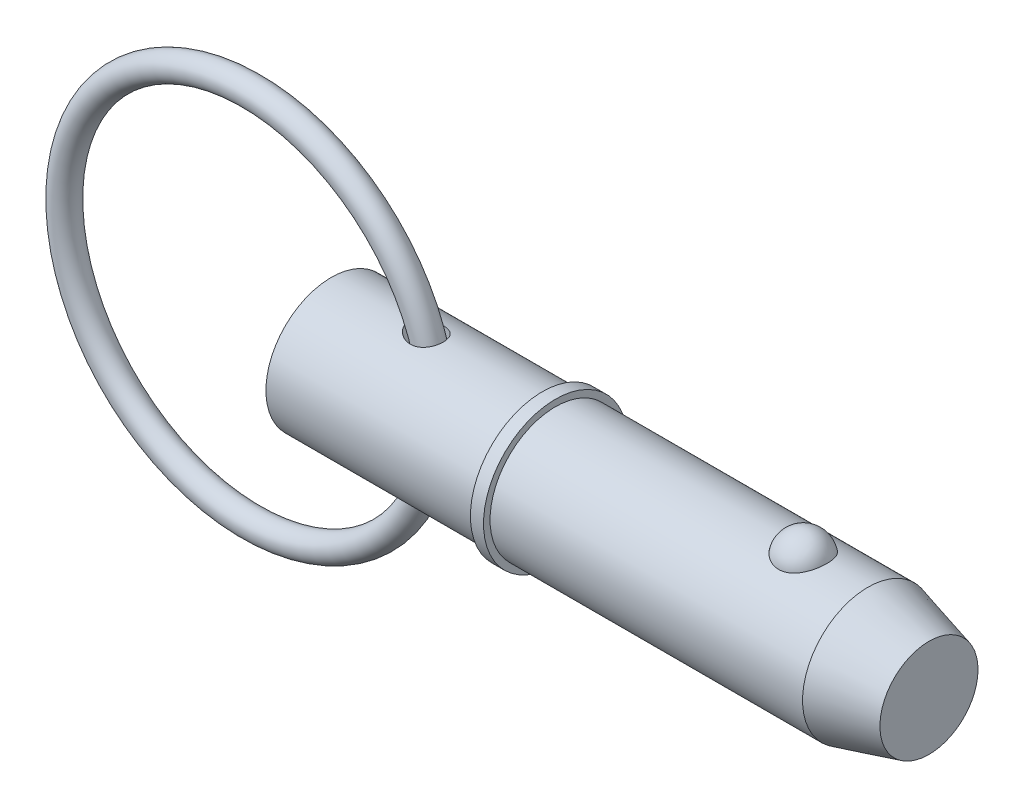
ISO-10303-21;
HEADER;
FILE_DESCRIPTION(('STEP AP214'),'2;1');
FILE_NAME('part.step','',(''),(''),'','','');
FILE_SCHEMA(('AUTOMOTIVE_DESIGN { 1 0 10303 214 1 1 1 1 }'));
ENDSEC;
DATA;
#1=APPLICATION_CONTEXT('core data for automotive mechanical design processes');
#2=APPLICATION_PROTOCOL_DEFINITION('international standard','automotive_design',2000,#1);
#3=PRODUCT_CONTEXT('',#1,'mechanical');
#4=PRODUCT('Part','Part','',(#3));
#5=PRODUCT_RELATED_PRODUCT_CATEGORY('part','',(#4));
#6=PRODUCT_DEFINITION_FORMATION('','',#4);
#7=PRODUCT_DEFINITION_CONTEXT('part definition',#1,'design');
#8=PRODUCT_DEFINITION('design','',#6,#7);
#9=PRODUCT_DEFINITION_SHAPE('','',#8);
#10=(LENGTH_UNIT() NAMED_UNIT(*) SI_UNIT(.MILLI.,.METRE.));
#11=(NAMED_UNIT(*) PLANE_ANGLE_UNIT() SI_UNIT($,.RADIAN.));
#12=(NAMED_UNIT(*) SI_UNIT($,.STERADIAN.) SOLID_ANGLE_UNIT());
#13=UNCERTAINTY_MEASURE_WITH_UNIT(LENGTH_MEASURE(1.E-05),#10,'distance_accuracy_value','');
#14=(GEOMETRIC_REPRESENTATION_CONTEXT(3) GLOBAL_UNCERTAINTY_ASSIGNED_CONTEXT((#13)) GLOBAL_UNIT_ASSIGNED_CONTEXT((#10,
#11,#12)) REPRESENTATION_CONTEXT('',''));
#15=CARTESIAN_POINT('',(0.,0.,0.));
#16=DIRECTION('',(0.,0.,1.));
#17=DIRECTION('',(1.,0.,0.));
#18=AXIS2_PLACEMENT_3D('',#15,#16,#17);
#19=CARTESIAN_POINT('',(-13.640845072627,0.,0.));
#20=DIRECTION('',(0.,0.,1.));
#21=DIRECTION('',(1.,0.,0.));
#22=AXIS2_PLACEMENT_3D('',#19,#20,#21);
#23=TOROIDAL_SURFACE('',#22,31.75,2.223);
#24=CARTESIAN_POINT('',(20.332154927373,0.,0.));
#25=VERTEX_POINT('',#24);
#26=VERTEX_LOOP('',#25);
#27=FACE_BOUND('',#26,.T.);
#28=ADVANCED_FACE('P0_F12',(#27),#23,.T.);
#29=CLOSED_SHELL('',(#28));
#30=MANIFOLD_SOLID_BREP('P0_B1',#29);
#31=CARTESIAN_POINT('',(0.,0.,0.));
#32=DIRECTION('',(1.,0.,0.));
#33=DIRECTION('',(0.,0.,-1.));
#34=AXIS2_PLACEMENT_3D('',#31,#32,#33);
#35=CYLINDRICAL_SURFACE('',#34,11.115);
#36=CARTESIAN_POINT('',(13.5245830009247,11.0328953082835,-1.34849772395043));
#37=CARTESIAN_POINT('',(13.6190616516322,11.0150940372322,-1.49413162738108));
#38=CARTESIAN_POINT('',(13.7272589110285,10.9954577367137,-1.63076546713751));
#39=CARTESIAN_POINT('',(13.9654537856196,10.9550099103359,-1.8834727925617));
#40=CARTESIAN_POINT('',(14.0954990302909,10.9341958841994,-1.99950019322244));
#41=CARTESIAN_POINT('',(14.3718600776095,10.893854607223,-2.20871939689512));
#42=CARTESIAN_POINT('',(14.5180879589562,10.8743212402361,-2.30202655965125));
#43=CARTESIAN_POINT('',(14.8233821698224,10.8385071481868,-2.46515115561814));
#44=CARTESIAN_POINT('',(14.9824448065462,10.8222254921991,-2.53497531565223));
#45=CARTESIAN_POINT('',(15.3233581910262,10.7936101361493,-2.65430007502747));
#46=CARTESIAN_POINT('',(15.5060064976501,10.7817126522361,-2.7016502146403));
#47=CARTESIAN_POINT('',(15.8771124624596,10.7657570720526,-2.76455948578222));
#48=CARTESIAN_POINT('',(16.0655695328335,10.7616981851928,-2.78012182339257));
#49=CARTESIAN_POINT('',(16.4345152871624,10.7624400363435,-2.77724928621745));
#50=CARTESIAN_POINT('',(16.6150121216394,10.7668823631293,-2.76018977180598));
#51=CARTESIAN_POINT('',(16.9695132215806,10.7837407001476,-2.69357457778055));
#52=CARTESIAN_POINT('',(17.1435222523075,10.7961507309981,-2.64404326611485));
#53=CARTESIAN_POINT('',(17.4621418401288,10.8258984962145,-2.51928348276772));
#54=CARTESIAN_POINT('',(17.6079677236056,10.8426430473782,-2.44700611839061));
#55=CARTESIAN_POINT('',(17.884162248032,10.8794194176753,-2.27791740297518));
#56=CARTESIAN_POINT('',(18.0145349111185,10.8994503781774,-2.18111245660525));
#57=CARTESIAN_POINT('',(18.2494965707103,10.9392822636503,-1.9713196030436));
#58=CARTESIAN_POINT('',(18.3550661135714,10.9590421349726,-1.85941863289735));
#59=CARTESIAN_POINT('',(18.5458147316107,10.9970986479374,-1.61919918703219));
#60=CARTESIAN_POINT('',(18.6309947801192,11.0153953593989,-1.49088149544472));
#61=CARTESIAN_POINT('',(18.7786686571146,11.0484675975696,-1.2218388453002));
#62=CARTESIAN_POINT('',(18.8412214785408,11.063252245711,-1.08114735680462));
#63=CARTESIAN_POINT('',(18.9425265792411,11.0877718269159,-0.791025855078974));
#64=CARTESIAN_POINT('',(18.9812780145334,11.0975065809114,-0.641595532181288));
#65=CARTESIAN_POINT('',(19.0343305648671,11.1109435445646,-0.336997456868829));
#66=CARTESIAN_POINT('',(19.0484404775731,11.1145985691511,-0.181794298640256));
#67=CARTESIAN_POINT('',(19.0513147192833,11.1153384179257,0.1288646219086));
#68=CARTESIAN_POINT('',(19.0400783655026,11.112423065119,0.284320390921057));
#69=CARTESIAN_POINT('',(18.9924362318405,11.1003163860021,0.591525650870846));
#70=CARTESIAN_POINT('',(18.9559600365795,11.0911075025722,0.743263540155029));
#71=CARTESIAN_POINT('',(18.858576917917,11.0673920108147,1.03825247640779));
#72=CARTESIAN_POINT('',(18.7976699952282,11.0528854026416,1.18150352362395));
#73=CARTESIAN_POINT('',(18.6529960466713,11.020201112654,1.45511394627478));
#74=CARTESIAN_POINT('',(18.5692772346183,11.0020311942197,1.58549973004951));
#75=CARTESIAN_POINT('',(18.3810003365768,10.9640237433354,1.82995492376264));
#76=CARTESIAN_POINT('',(18.2764441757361,10.9441863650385,1.9440258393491));
#77=CARTESIAN_POINT('',(18.0501398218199,10.9052267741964,2.15183128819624));
#78=CARTESIAN_POINT('',(17.9285270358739,10.8861003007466,2.24571250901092));
#79=CARTESIAN_POINT('',(17.6709592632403,10.8505244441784,2.41175942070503));
#80=CARTESIAN_POINT('',(17.5350055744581,10.8340748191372,2.48392707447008));
#81=CARTESIAN_POINT('',(17.2528390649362,10.8056099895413,2.60497667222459));
#82=CARTESIAN_POINT('',(17.1066353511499,10.7935909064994,2.65387899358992));
#83=CARTESIAN_POINT('',(16.8080326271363,10.7750969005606,2.72799859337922));
#84=CARTESIAN_POINT('',(16.6556326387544,10.7686228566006,2.75321211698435));
#85=CARTESIAN_POINT('',(16.3428877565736,10.761517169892,2.78086153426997));
#86=CARTESIAN_POINT('',(16.1824599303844,10.7611149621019,2.78240297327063));
#87=CARTESIAN_POINT('',(15.863296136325,10.766478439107,2.76156874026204));
#88=CARTESIAN_POINT('',(15.7045607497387,10.7722461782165,2.73918510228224));
#89=CARTESIAN_POINT('',(15.3787211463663,10.7898500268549,2.66904167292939));
#90=CARTESIAN_POINT('',(15.2120794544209,10.8021675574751,2.6192557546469));
#91=CARTESIAN_POINT('',(14.8886284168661,10.8315482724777,2.4949635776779));
#92=CARTESIAN_POINT('',(14.731827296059,10.8486153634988,2.42043695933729));
#93=CARTESIAN_POINT('',(14.4198762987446,10.8870804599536,2.24137362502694));
#94=CARTESIAN_POINT('',(14.2658484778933,10.9087148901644,2.13492229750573));
#95=CARTESIAN_POINT('',(13.9788214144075,10.9526299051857,1.89676517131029));
#96=CARTESIAN_POINT('',(13.845804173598,10.9749099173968,1.76508120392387));
#97=CARTESIAN_POINT('',(13.6310853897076,11.012885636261,1.50762337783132));
#98=CARTESIAN_POINT('',(13.5444453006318,11.0290026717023,1.38602082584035));
#99=CARTESIAN_POINT('',(13.392158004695,11.0581740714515,1.12983363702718));
#100=CARTESIAN_POINT('',(13.3264946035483,11.0712307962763,0.995259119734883));
#101=CARTESIAN_POINT('',(13.2464179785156,11.0874250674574,0.785640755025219));
#102=CARTESIAN_POINT('',(13.2227369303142,11.0922707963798,0.71416661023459));
#103=CARTESIAN_POINT('',(13.1820656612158,11.1006486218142,0.56927708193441));
#104=CARTESIAN_POINT('',(13.1650721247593,11.1041813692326,0.495862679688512));
#105=CARTESIAN_POINT('',(13.1381118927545,11.1098070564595,0.34771199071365));
#106=CARTESIAN_POINT('',(13.1281436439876,11.1119003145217,0.272975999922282));
#107=CARTESIAN_POINT('',(13.1154243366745,11.1145746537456,0.122890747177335));
#108=CARTESIAN_POINT('',(13.1126723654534,11.1151559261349,0.0475415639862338));
#109=CARTESIAN_POINT('',(13.1151602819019,11.1146296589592,-0.160384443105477));
#110=CARTESIAN_POINT('',(13.128061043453,11.111903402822,-0.292944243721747));
#111=CARTESIAN_POINT('',(13.175691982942,11.1019662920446,-0.553751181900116));
#112=CARTESIAN_POINT('',(13.2104121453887,11.094757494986,-0.682000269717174));
#113=CARTESIAN_POINT('',(13.2891255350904,11.0787645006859,-0.901873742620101));
#114=CARTESIAN_POINT('',(13.3290466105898,11.0707438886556,-0.995044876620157));
#115=CARTESIAN_POINT('',(13.4192915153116,11.0529876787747,-1.175992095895));
#116=CARTESIAN_POINT('',(13.4696154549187,11.0432520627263,-1.26376812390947));
#117=CARTESIAN_POINT('',(13.5245830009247,11.0328953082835,-1.34849772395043));
#118=B_SPLINE_CURVE_WITH_KNOTS('',3,(#36,#37,#38,#39,#40,#41,#42,#43,#44,#45,#46,#47,#48,#49,
#50,#51,#52,#53,#54,#55,#56,#57,#58,#59,#60,#61,#62,#63,#64,#65,#66,#67,#68,#69,#70,#71,#72,#73,
#74,#75,#76,#77,#78,#79,#80,#81,#82,#83,#84,#85,#86,#87,#88,#89,#90,#91,#92,#93,#94,#95,#96,#97,
#98,#99,#100,#101,#102,#103,#104,#105,#106,#107,#108,#109,#110,#111,#112,#113,#114,#115,#116,
#117),.UNSPECIFIED.,.T.,.F.,(4,2,2,2,2,2,2,2,2,2,2,2,2,2,2,2,2,2,2,2,2,2,2,2,2,2,2,2,2,2,2,2,2,
2,2,2,2,2,2,2,4),(0.,0.523099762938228,1.04735506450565,1.5688902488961,2.09027590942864,
2.65465173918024,3.21897064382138,3.76002078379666,4.30066536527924,4.78898318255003,
5.27717362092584,5.74028268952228,6.20336964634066,6.66524040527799,7.12712754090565,
7.59258295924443,8.05805091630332,8.52482272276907,8.99159451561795,9.45738731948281,
9.92313710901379,10.3853792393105,10.8475795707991,11.3093743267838,11.771242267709,
12.2505208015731,12.7299589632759,13.2508366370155,13.7721440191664,14.334890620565,
14.8971525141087,15.3459336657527,15.7943675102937,16.0204422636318,16.2464047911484,
16.4723173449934,16.6982013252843,17.095711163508,17.4930386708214,17.7973741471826,
18.1017128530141),.UNSPECIFIED.);
#119=CARTESIAN_POINT('',(13.5245830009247,11.0328953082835,-1.34849772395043));
#120=VERTEX_POINT('',#119);
#121=EDGE_CURVE('P1_E42',#120,#120,#118,.T.);
#122=ORIENTED_EDGE('',*,*,#121,.T.);
#123=EDGE_LOOP('',(#122));
#124=FACE_BOUND('',#123,.T.);
#125=CARTESIAN_POINT('',(0.,0.,0.));
#126=DIRECTION('',(1.,0.,0.));
#127=DIRECTION('',(0.,0.,-1.));
#128=AXIS2_PLACEMENT_3D('',#125,#126,#127);
#129=CIRCLE('',#128,11.115);
#130=CARTESIAN_POINT('',(0.,0.,-11.115));
#131=VERTEX_POINT('',#130);
#132=EDGE_CURVE('P1_E9',#131,#131,#129,.T.);
#133=ORIENTED_EDGE('',*,*,#132,.T.);
#134=EDGE_LOOP('',(#133));
#135=FACE_BOUND('',#134,.T.);
#136=CARTESIAN_POINT('',(35.877,0.,0.));
#137=DIRECTION('',(1.,0.,0.));
#138=DIRECTION('',(0.,0.,-1.));
#139=AXIS2_PLACEMENT_3D('',#136,#137,#138);
#140=CIRCLE('',#139,11.115);
#141=CARTESIAN_POINT('',(35.877,0.,-11.115));
#142=VERTEX_POINT('',#141);
#143=EDGE_CURVE('P1_E25',#142,#142,#140,.T.);
#144=ORIENTED_EDGE('',*,*,#143,.F.);
#145=EDGE_LOOP('',(#144));
#146=FACE_BOUND('',#145,.T.);
#147=CARTESIAN_POINT('',(13.5245830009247,-11.0328953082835,-1.34849772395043));
#148=CARTESIAN_POINT('',(13.449887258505,-11.0469690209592,-1.233356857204));
#149=CARTESIAN_POINT('',(13.3837464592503,-11.0598986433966,-1.11255897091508));
#150=CARTESIAN_POINT('',(13.271526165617,-11.0822620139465,-0.861680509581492));
#151=CARTESIAN_POINT('',(13.2254273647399,-11.0916991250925,-0.731609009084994));
#152=CARTESIAN_POINT('',(13.1557497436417,-11.1060943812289,-0.464578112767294));
#153=CARTESIAN_POINT('',(13.1322820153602,-11.111030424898,-0.327588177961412));
#154=CARTESIAN_POINT('',(13.1098958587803,-11.1157368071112,-0.0515139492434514));
#155=CARTESIAN_POINT('',(13.1109730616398,-11.1155080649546,0.087569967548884));
#156=CARTESIAN_POINT('',(13.1367722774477,-11.110088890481,0.354927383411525));
#157=CARTESIAN_POINT('',(13.160070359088,-11.1051972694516,0.483348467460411));
#158=CARTESIAN_POINT('',(13.2268311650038,-11.091413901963,0.734581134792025));
#159=CARTESIAN_POINT('',(13.2702981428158,-11.0825213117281,0.857391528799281));
#160=CARTESIAN_POINT('',(13.3769008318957,-11.0612491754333,1.09871322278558));
#161=CARTESIAN_POINT('',(13.4406446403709,-11.048763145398,1.21694419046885));
#162=CARTESIAN_POINT('',(13.5844860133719,-11.0215642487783,1.44267020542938));
#163=CARTESIAN_POINT('',(13.6645903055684,-11.0068504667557,1.55016080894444));
#164=CARTESIAN_POINT('',(13.8511803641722,-10.9741237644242,1.76795565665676));
#165=CARTESIAN_POINT('',(13.959808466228,-10.9559422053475,1.87639683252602));
#166=CARTESIAN_POINT('',(14.1916437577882,-10.9197998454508,2.07642617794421));
#167=CARTESIAN_POINT('',(14.3148607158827,-10.901839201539,2.16800294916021));
#168=CARTESIAN_POINT('',(14.5931107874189,-10.8649902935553,2.34622033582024));
#169=CARTESIAN_POINT('',(14.7501095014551,-10.8463937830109,2.42986679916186));
#170=CARTESIAN_POINT('',(15.0757118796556,-10.8136392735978,2.57171975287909));
#171=CARTESIAN_POINT('',(15.2443214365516,-10.7994835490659,2.62991321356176));
#172=CARTESIAN_POINT('',(15.599068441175,-10.7767894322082,2.72147498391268));
#173=CARTESIAN_POINT('',(15.7856559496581,-10.768622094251,2.75321798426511));
#174=CARTESIAN_POINT('',(16.1617095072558,-10.7608206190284,2.78356776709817));
#175=CARTESIAN_POINT('',(16.3511739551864,-10.7611818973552,2.78219235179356));
#176=CARTESIAN_POINT('',(16.7138126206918,-10.7705428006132,2.7457129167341));
#177=CARTESIAN_POINT('',(16.8872269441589,-10.7789612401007,2.71287798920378));
#178=CARTESIAN_POINT('',(17.2247245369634,-10.8028011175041,2.61632772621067));
#179=CARTESIAN_POINT('',(17.3888134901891,-10.8182182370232,2.55263143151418));
#180=CARTESIAN_POINT('',(17.6871641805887,-10.8524191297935,2.40281428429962));
#181=CARTESIAN_POINT('',(17.8227812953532,-10.8707652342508,2.31928155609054));
#182=CARTESIAN_POINT('',(18.0770765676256,-10.9094513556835,2.12988301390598));
#183=CARTESIAN_POINT('',(18.1957578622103,-10.9297910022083,2.02402134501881));
#184=CARTESIAN_POINT('',(18.4088055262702,-10.9693230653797,1.79719870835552));
#185=CARTESIAN_POINT('',(18.5038890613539,-10.9885305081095,1.67691225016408));
#186=CARTESIAN_POINT('',(18.6726701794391,-11.0244347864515,1.42183894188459));
#187=CARTESIAN_POINT('',(18.7463681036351,-11.0411316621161,1.28705232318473));
#188=CARTESIAN_POINT('',(18.8708297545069,-11.0702507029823,1.00634471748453));
#189=CARTESIAN_POINT('',(18.9215212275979,-11.0826593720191,0.860390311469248));
#190=CARTESIAN_POINT('',(18.9984973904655,-11.1017993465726,0.561823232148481));
#191=CARTESIAN_POINT('',(19.0247811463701,-11.1085304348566,0.409210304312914));
#192=CARTESIAN_POINT('',(19.0524622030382,-11.1156244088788,0.100537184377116));
#193=CARTESIAN_POINT('',(19.0536873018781,-11.1159432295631,-0.0555394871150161));
#194=CARTESIAN_POINT('',(19.0307837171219,-11.110065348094,-0.365700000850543));
#195=CARTESIAN_POINT('',(19.0066544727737,-11.1038685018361,-0.519783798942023));
#196=CARTESIAN_POINT('',(18.9335163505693,-11.0856111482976,-0.821817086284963));
#197=CARTESIAN_POINT('',(18.8844701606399,-11.0735418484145,-0.969757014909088));
#198=CARTESIAN_POINT('',(18.7625929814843,-11.0448501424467,-1.25502066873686));
#199=CARTESIAN_POINT('',(18.6897623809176,-11.0282278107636,-1.39234456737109));
#200=CARTESIAN_POINT('',(18.522359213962,-10.9923333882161,-1.65195905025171));
#201=CARTESIAN_POINT('',(18.427863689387,-10.9730707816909,-1.77430060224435));
#202=CARTESIAN_POINT('',(18.2194216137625,-10.9340072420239,-2.00099176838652));
#203=CARTESIAN_POINT('',(18.1054772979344,-10.9142063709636,-2.10534344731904));
#204=CARTESIAN_POINT('',(17.8622613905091,-10.8764452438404,-2.2924289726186));
#205=CARTESIAN_POINT('',(17.7331196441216,-10.8584715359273,-2.3753290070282));
#206=CARTESIAN_POINT('',(17.4625069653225,-10.8261386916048,-2.51860389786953));
#207=CARTESIAN_POINT('',(17.3210365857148,-10.8117793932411,-2.57897976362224));
#208=CARTESIAN_POINT('',(17.0290309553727,-10.7880576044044,-2.67648805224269));
#209=CARTESIAN_POINT('',(16.8784484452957,-10.7787241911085,-2.71348542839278));
#210=CARTESIAN_POINT('',(16.573148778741,-10.7659618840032,-2.7636855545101));
#211=CARTESIAN_POINT('',(16.4184306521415,-10.7625343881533,-2.77688267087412));
#212=CARTESIAN_POINT('',(16.1008073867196,-10.761643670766,-2.78033419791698));
#213=CARTESIAN_POINT('',(15.9378898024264,-10.7644957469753,-2.76937572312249));
#214=CARTESIAN_POINT('',(15.6157286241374,-10.7762062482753,-2.72344300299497));
#215=CARTESIAN_POINT('',(15.4564861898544,-10.7850665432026,-2.68846128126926));
#216=CARTESIAN_POINT('',(15.1305734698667,-10.808737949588,-2.59174021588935));
#217=CARTESIAN_POINT('',(14.9645834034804,-10.8240246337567,-2.52782071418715));
#218=CARTESIAN_POINT('',(14.6448218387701,-10.8585969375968,-2.37491543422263));
#219=CARTESIAN_POINT('',(14.4910653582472,-10.8778873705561,-2.28589943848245));
#220=CARTESIAN_POINT('',(14.1837929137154,-10.920550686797,-2.07312951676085));
#221=CARTESIAN_POINT('',(14.0321999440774,-10.9441390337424,-1.94661563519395));
#222=CARTESIAN_POINT('',(13.756115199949,-10.9902311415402,-1.66673537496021));
#223=CARTESIAN_POINT('',(13.6315733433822,-11.0127368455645,-1.51341958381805));
#224=CARTESIAN_POINT('',(13.5245830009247,-11.0328953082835,-1.34849772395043));
#225=B_SPLINE_CURVE_WITH_KNOTS('',3,(#147,#148,#149,#150,#151,#152,#153,#154,#155,#156,#157,
#158,#159,#160,#161,#162,#163,#164,#165,#166,#167,#168,#169,#170,#171,#172,#173,#174,#175,#176,
#177,#178,#179,#180,#181,#182,#183,#184,#185,#186,#187,#188,#189,#190,#191,#192,#193,#194,#195,
#196,#197,#198,#199,#200,#201,#202,#203,#204,#205,#206,#207,#208,#209,#210,#211,#212,#213,#214,
#215,#216,#217,#218,#219,#220,#221,#222,#223,#224),.UNSPECIFIED.,.T.,.F.,(4,2,2,2,2,2,2,2,2,2,2,
2,2,2,2,2,2,2,2,2,2,2,2,2,2,2,2,2,2,2,2,2,2,2,2,2,2,2,4),(0.,0.413394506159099,
0.826389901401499,1.24140245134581,1.65634113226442,2.04635967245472,2.43646050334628,
2.83958259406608,3.24287078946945,3.70479277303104,4.16702582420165,4.70130512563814,
5.23585761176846,5.80123945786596,6.36631739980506,6.89348344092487,7.42032464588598,
7.8989135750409,8.37741373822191,8.83881993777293,9.30021877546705,9.76305681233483,
10.2259125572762,10.6919479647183,11.1579936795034,11.6247393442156,12.0914773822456,
12.55658073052,13.0216306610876,13.4829619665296,13.9442725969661,14.408224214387,
14.8722856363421,15.3601762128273,15.8482186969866,16.3815107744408,16.9154477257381,
17.5086806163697,18.1008056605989),.UNSPECIFIED.);
#226=CARTESIAN_POINT('',(13.5245830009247,-11.0328953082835,-1.34849772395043));
#227=VERTEX_POINT('',#226);
#228=EDGE_CURVE('P1_E17',#227,#227,#225,.T.);
#229=ORIENTED_EDGE('',*,*,#228,.T.);
#230=EDGE_LOOP('',(#229));
#231=FACE_BOUND('',#230,.T.);
#232=ADVANCED_FACE('P1_F13',(#124,#135,#146,#231),#35,.T.);
#233=CARTESIAN_POINT('',(0.,0.,0.));
#234=DIRECTION('',(1.,0.,0.));
#235=DIRECTION('',(0.,0.,-1.));
#236=AXIS2_PLACEMENT_3D('',#233,#234,#235);
#237=CYLINDRICAL_SURFACE('',#236,11.115);
#238=CARTESIAN_POINT('',(91.2295638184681,0.,0.));
#239=DIRECTION('',(1.,0.,0.));
#240=DIRECTION('',(0.,0.,-1.));
#241=AXIS2_PLACEMENT_3D('',#238,#239,#240);
#242=CIRCLE('',#241,11.115);
#243=CARTESIAN_POINT('',(91.2295638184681,0.,-11.115));
#244=VERTEX_POINT('',#243);
#245=EDGE_CURVE('P1_E99',#244,#244,#242,.T.);
#246=ORIENTED_EDGE('',*,*,#245,.F.);
#247=EDGE_LOOP('',(#246));
#248=FACE_BOUND('',#247,.T.);
#249=CARTESIAN_POINT('',(38.1,0.,0.));
#250=DIRECTION('',(1.,0.,0.));
#251=DIRECTION('',(0.,0.,-1.));
#252=AXIS2_PLACEMENT_3D('',#249,#250,#251);
#253=CIRCLE('',#252,11.115);
#254=CARTESIAN_POINT('',(38.1,0.,-11.115));
#255=VERTEX_POINT('',#254);
#256=EDGE_CURVE('P1_E96',#255,#255,#253,.T.);
#257=ORIENTED_EDGE('',*,*,#256,.T.);
#258=EDGE_LOOP('',(#257));
#259=FACE_BOUND('',#258,.T.);
#260=CARTESIAN_POINT('',(80.2310680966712,10.3028087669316,4.17077409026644));
#261=CARTESIAN_POINT('',(80.0147756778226,10.3028003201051,4.17078240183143));
#262=CARTESIAN_POINT('',(79.7985488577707,10.3098895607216,4.15340593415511));
#263=CARTESIAN_POINT('',(79.3725408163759,10.3373834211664,4.08449540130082));
#264=CARTESIAN_POINT('',(79.1627577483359,10.3577841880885,4.03297121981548));
#265=CARTESIAN_POINT('',(78.7557825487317,10.4095237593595,3.89746513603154));
#266=CARTESIAN_POINT('',(78.5585726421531,10.4408466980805,3.8135302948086));
#267=CARTESIAN_POINT('',(78.1813382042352,10.5110236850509,3.61560339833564));
#268=CARTESIAN_POINT('',(78.0013171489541,10.5498792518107,3.50160528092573));
#269=CARTESIAN_POINT('',(77.6576842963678,10.6322884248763,3.2429246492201));
#270=CARTESIAN_POINT('',(77.4946861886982,10.6759443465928,3.09746040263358));
#271=CARTESIAN_POINT('',(77.1945911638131,10.7625291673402,2.78171925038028));
#272=CARTESIAN_POINT('',(77.0574990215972,10.8054579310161,2.61143778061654));
#273=CARTESIAN_POINT('',(76.8064084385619,10.8881935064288,2.24226695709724));
#274=CARTESIAN_POINT('',(76.6937105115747,10.9277761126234,2.04244123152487));
#275=CARTESIAN_POINT('',(76.5017771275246,10.997484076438,1.62578254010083));
#276=CARTESIAN_POINT('',(76.4225446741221,11.0276085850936,1.40894804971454));
#277=CARTESIAN_POINT('',(76.2983034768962,11.0756732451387,0.961250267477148));
#278=CARTESIAN_POINT('',(76.253760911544,11.0934470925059,0.73023943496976));
#279=CARTESIAN_POINT('',(76.2015695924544,11.1143331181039,0.263439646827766));
#280=CARTESIAN_POINT('',(76.1939200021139,11.1174456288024,0.0276507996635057));
#281=CARTESIAN_POINT('',(76.2156105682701,11.1087161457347,-0.440729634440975));
#282=CARTESIAN_POINT('',(76.2447624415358,11.0969502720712,-0.673331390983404));
#283=CARTESIAN_POINT('',(76.3391432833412,11.0597872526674,-1.12996621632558));
#284=CARTESIAN_POINT('',(76.4043729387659,11.0343898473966,-1.35399912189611));
#285=CARTESIAN_POINT('',(76.5696984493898,10.972515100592,-1.78750286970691));
#286=CARTESIAN_POINT('',(76.6698386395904,10.9360236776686,-1.99695478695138));
#287=CARTESIAN_POINT('',(76.9029408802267,10.8557595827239,-2.39520667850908));
#288=CARTESIAN_POINT('',(77.035905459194,10.8119863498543,-2.58400506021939));
#289=CARTESIAN_POINT('',(77.3324076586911,10.7216733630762,-2.93635726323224));
#290=CARTESIAN_POINT('',(77.4960565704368,10.675123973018,-3.09981510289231));
#291=CARTESIAN_POINT('',(77.8498601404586,10.5846571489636,-3.3959224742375));
#292=CARTESIAN_POINT('',(78.0400123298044,10.5407394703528,-3.5285748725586));
#293=CARTESIAN_POINT('',(78.4375014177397,10.4616690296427,-3.75646057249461));
#294=CARTESIAN_POINT('',(78.6443670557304,10.4263443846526,-3.85245432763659));
#295=CARTESIAN_POINT('',(79.0729541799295,10.3675574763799,-4.00798747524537));
#296=CARTESIAN_POINT('',(79.294670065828,10.344090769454,-4.06754052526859));
#297=CARTESIAN_POINT('',(79.7346695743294,10.3128282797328,-4.14614314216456));
#298=CARTESIAN_POINT('',(79.9525654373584,10.3043040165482,-4.16707833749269));
#299=CARTESIAN_POINT('',(80.38894951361,10.3016771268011,-4.17357158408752));
#300=CARTESIAN_POINT('',(80.6074376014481,10.3075716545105,-4.15913661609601));
#301=CARTESIAN_POINT('',(81.0317442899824,10.3326686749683,-4.09636961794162));
#302=CARTESIAN_POINT('',(81.2377458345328,10.3514555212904,-4.04909574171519));
#303=CARTESIAN_POINT('',(81.6385764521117,10.399818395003,-3.92320197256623));
#304=CARTESIAN_POINT('',(81.8334046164,10.4293952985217,-3.8445795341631));
#305=CARTESIAN_POINT('',(82.2111917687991,10.4969600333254,-3.65612410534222));
#306=CARTESIAN_POINT('',(82.3937974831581,10.5351178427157,-3.54564545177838));
#307=CARTESIAN_POINT('',(82.7382040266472,10.6154999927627,-3.2971803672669));
#308=CARTESIAN_POINT('',(82.900000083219,10.657725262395,-3.15918764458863));
#309=CARTESIAN_POINT('',(83.2069596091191,10.744212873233,-2.85163580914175));
#310=CARTESIAN_POINT('',(83.3508919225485,10.7884718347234,-2.68084605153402));
#311=CARTESIAN_POINT('',(83.6092371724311,10.872374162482,-2.3172186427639));
#312=CARTESIAN_POINT('',(83.7236448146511,10.9120167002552,-2.12437704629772));
#313=CARTESIAN_POINT('',(83.9238739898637,10.9838919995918,-1.71516999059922));
#314=CARTESIAN_POINT('',(84.0086617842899,11.0158465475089,-1.49824866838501));
#315=CARTESIAN_POINT('',(84.1426838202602,11.0673523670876,-1.052285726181));
#316=CARTESIAN_POINT('',(84.1919174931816,11.086903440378,-0.8232439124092));
#317=CARTESIAN_POINT('',(84.2538915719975,11.1116323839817,-0.359087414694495));
#318=CARTESIAN_POINT('',(84.2665662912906,11.1167843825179,-0.123962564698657));
#319=CARTESIAN_POINT('',(84.254973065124,11.1121144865,0.345220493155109));
#320=CARTESIAN_POINT('',(84.2307056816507,11.1022928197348,0.579278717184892));
#321=CARTESIAN_POINT('',(84.1459073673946,11.0687504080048,1.03866534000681));
#322=CARTESIAN_POINT('',(84.0855299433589,11.0450885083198,1.26402641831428));
#323=CARTESIAN_POINT('',(83.9298532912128,10.9863185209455,1.70076772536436));
#324=CARTESIAN_POINT('',(83.834551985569,10.9512097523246,1.91214712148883));
#325=CARTESIAN_POINT('',(83.6103974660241,10.8729733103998,2.31608359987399));
#326=CARTESIAN_POINT('',(83.4813806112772,10.8298068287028,2.50854240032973));
#327=CARTESIAN_POINT('',(83.1927327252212,10.7401896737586,2.86808766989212));
#328=CARTESIAN_POINT('',(83.0331022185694,10.6937390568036,3.03517457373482));
#329=CARTESIAN_POINT('',(82.6875341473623,10.6029321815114,3.33857581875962));
#330=CARTESIAN_POINT('',(82.5017089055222,10.5585680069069,3.47501541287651));
#331=CARTESIAN_POINT('',(82.1078750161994,10.4769321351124,3.71390897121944));
#332=CARTESIAN_POINT('',(81.8998635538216,10.439661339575,3.81635861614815));
#333=CARTESIAN_POINT('',(81.4540666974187,10.3749407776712,3.98910631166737));
#334=CARTESIAN_POINT('',(81.2152342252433,10.3482457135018,4.05700929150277));
#335=CARTESIAN_POINT('',(80.7279254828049,10.312188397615,4.14782844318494));
#336=CARTESIAN_POINT('',(80.4794535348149,10.3028184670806,4.17076454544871));
#337=CARTESIAN_POINT('',(80.2310680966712,10.3028087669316,4.17077409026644));
#338=B_SPLINE_CURVE_WITH_KNOTS('',3,(#260,#261,#262,#263,#264,#265,#266,#267,#268,#269,#270,
#271,#272,#273,#274,#275,#276,#277,#278,#279,#280,#281,#282,#283,#284,#285,#286,#287,#288,#289,
#290,#291,#292,#293,#294,#295,#296,#297,#298,#299,#300,#301,#302,#303,#304,#305,#306,#307,#308,
#309,#310,#311,#312,#313,#314,#315,#316,#317,#318,#319,#320,#321,#322,#323,#324,#325,#326,#327,
#328,#329,#330,#331,#332,#333,#334,#335,#336,#337),.UNSPECIFIED.,.T.,.F.,(4,2,2,2,2,2,2,2,2,2,2,
2,2,2,2,2,2,2,2,2,2,2,2,2,2,2,2,2,2,2,2,2,2,2,2,2,2,2,4),(0.,0.647966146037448,1.29574482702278,
1.94258643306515,2.58955857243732,3.25496465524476,3.92049326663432,4.61566368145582,
5.31089647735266,6.01531821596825,6.71972398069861,7.42054043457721,8.12137023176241,
8.82309331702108,9.52487047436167,10.2292439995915,10.9335519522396,11.6223330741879,
12.31085589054,12.96476640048,13.6185478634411,14.252184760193,14.8858731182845,
15.5334360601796,16.1811472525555,16.8611459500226,17.5412664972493,18.2431855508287,
18.9451158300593,19.6483065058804,20.3514864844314,21.0516982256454,21.7519516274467,
22.4556690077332,23.1593743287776,23.860149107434,24.5610129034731,25.3054529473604,
26.0495629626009),.UNSPECIFIED.);
#339=CARTESIAN_POINT('',(80.2310680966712,10.3028087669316,4.17077409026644));
#340=VERTEX_POINT('',#339);
#341=EDGE_CURVE('P1_E34',#340,#340,#338,.T.);
#342=ORIENTED_EDGE('',*,*,#341,.T.);
#343=EDGE_LOOP('',(#342));
#344=FACE_BOUND('',#343,.T.);
#345=ADVANCED_FACE('P1_F46',(#248,#259,#344),#237,.T.);
#346=CARTESIAN_POINT('',(0.,0.,0.));
#347=DIRECTION('',(-1.,0.,0.));
#348=DIRECTION('',(0.,0.,1.));
#349=AXIS2_PLACEMENT_3D('',#346,#347,#348);
#350=PLANE('',#349);
#351=ORIENTED_EDGE('',*,*,#132,.F.);
#352=EDGE_LOOP('',(#351));
#353=FACE_BOUND('',#352,.T.);
#354=ADVANCED_FACE('P1_F15',(#353),#350,.T.);
#355=CARTESIAN_POINT('',(35.877,11.115,0.));
#356=DIRECTION('',(-1.,0.,0.));
#357=DIRECTION('',(0.,0.,1.));
#358=AXIS2_PLACEMENT_3D('',#355,#356,#357);
#359=PLANE('',#358);
#360=ORIENTED_EDGE('',*,*,#143,.T.);
#361=EDGE_LOOP('',(#360));
#362=FACE_BOUND('',#361,.T.);
#363=CARTESIAN_POINT('',(35.877,0.,0.));
#364=DIRECTION('',(1.,0.,0.));
#365=DIRECTION('',(0.,0.,-1.));
#366=AXIS2_PLACEMENT_3D('',#363,#364,#365);
#367=CIRCLE('',#366,12.2265);
#368=CARTESIAN_POINT('',(35.877,0.,-12.2265));
#369=VERTEX_POINT('',#368);
#370=EDGE_CURVE('P1_E30',#369,#369,#367,.T.);
#371=ORIENTED_EDGE('',*,*,#370,.F.);
#372=EDGE_LOOP('',(#371));
#373=FACE_BOUND('',#372,.T.);
#374=ADVANCED_FACE('P1_F81',(#362,#373),#359,.T.);
#375=CARTESIAN_POINT('',(0.,0.,0.));
#376=DIRECTION('',(1.,0.,0.));
#377=DIRECTION('',(0.,0.,-1.));
#378=AXIS2_PLACEMENT_3D('',#375,#376,#377);
#379=CYLINDRICAL_SURFACE('',#378,12.2265);
#380=ORIENTED_EDGE('',*,*,#370,.T.);
#381=EDGE_LOOP('',(#380));
#382=FACE_BOUND('',#381,.T.);
#383=CARTESIAN_POINT('',(38.1,0.,0.));
#384=DIRECTION('',(1.,0.,0.));
#385=DIRECTION('',(0.,0.,-1.));
#386=AXIS2_PLACEMENT_3D('',#383,#384,#385);
#387=CIRCLE('',#386,12.2265);
#388=CARTESIAN_POINT('',(38.1,0.,-12.2265));
#389=VERTEX_POINT('',#388);
#390=EDGE_CURVE('P1_E95',#389,#389,#387,.T.);
#391=ORIENTED_EDGE('',*,*,#390,.F.);
#392=EDGE_LOOP('',(#391));
#393=FACE_BOUND('',#392,.T.);
#394=ADVANCED_FACE('P1_F68',(#382,#393),#379,.T.);
#395=CARTESIAN_POINT('',(38.1,12.2265,0.));
#396=DIRECTION('',(1.,0.,0.));
#397=DIRECTION('',(0.,0.,-1.));
#398=AXIS2_PLACEMENT_3D('',#395,#396,#397);
#399=PLANE('',#398);
#400=ORIENTED_EDGE('',*,*,#390,.T.);
#401=EDGE_LOOP('',(#400));
#402=FACE_BOUND('',#401,.T.);
#403=ORIENTED_EDGE('',*,*,#256,.F.);
#404=EDGE_LOOP('',(#403));
#405=FACE_BOUND('',#404,.T.);
#406=ADVANCED_FACE('P1_F62',(#402,#405),#399,.T.);
#407=CARTESIAN_POINT('',(101.6,0.,0.));
#408=DIRECTION('',(-1.,0.,0.));
#409=DIRECTION('',(0.,0.,1.));
#410=AXIS2_PLACEMENT_3D('',#407,#408,#409);
#411=CONICAL_SURFACE('',#410,8.33625000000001,0.26179938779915);
#412=ORIENTED_EDGE('',*,*,#245,.T.);
#413=EDGE_LOOP('',(#412));
#414=FACE_BOUND('',#413,.T.);
#415=CARTESIAN_POINT('',(101.6,0.,0.));
#416=DIRECTION('',(1.,0.,0.));
#417=DIRECTION('',(0.,0.,-1.));
#418=AXIS2_PLACEMENT_3D('',#415,#416,#417);
#419=CIRCLE('',#418,8.33625000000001);
#420=CARTESIAN_POINT('',(101.6,0.,-8.33625000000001));
#421=VERTEX_POINT('',#420);
#422=EDGE_CURVE('P1_E41',#421,#421,#419,.T.);
#423=ORIENTED_EDGE('',*,*,#422,.F.);
#424=EDGE_LOOP('',(#423));
#425=FACE_BOUND('',#424,.T.);
#426=ADVANCED_FACE('P1_F59',(#414,#425),#411,.T.);
#427=CARTESIAN_POINT('',(101.6,8.33625000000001,0.));
#428=DIRECTION('',(1.,0.,0.));
#429=DIRECTION('',(0.,0.,-1.));
#430=AXIS2_PLACEMENT_3D('',#427,#428,#429);
#431=PLANE('',#430);
#432=ORIENTED_EDGE('',*,*,#422,.T.);
#433=EDGE_LOOP('',(#432));
#434=FACE_BOUND('',#433,.T.);
#435=ADVANCED_FACE('P1_F55',(#434),#431,.T.);
#436=CARTESIAN_POINT('',(80.2310680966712,10.0035,0.));
#437=DIRECTION('',(-1.,0.,0.));
#438=DIRECTION('',(0.,1.,0.));
#439=AXIS2_PLACEMENT_3D('',#436,#437,#438);
#440=SPHERICAL_SURFACE('',#439,4.18149999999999);
#441=ORIENTED_EDGE('',*,*,#341,.F.);
#442=EDGE_LOOP('',(#441));
#443=FACE_BOUND('',#442,.T.);
#444=ADVANCED_FACE('P1_F50',(#443),#440,.T.);
#445=CARTESIAN_POINT('',(-13.640845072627,0.,0.));
#446=DIRECTION('',(0.,0.,1.));
#447=DIRECTION('',(1.,0.,0.));
#448=AXIS2_PLACEMENT_3D('',#445,#446,#447);
#449=TOROIDAL_SURFACE('',#448,31.75,2.77875);
#450=ORIENTED_EDGE('',*,*,#228,.F.);
#451=EDGE_LOOP('',(#450));
#452=FACE_BOUND('',#451,.T.);
#453=ORIENTED_EDGE('',*,*,#121,.F.);
#454=EDGE_LOOP('',(#453));
#455=FACE_BOUND('',#454,.T.);
#456=ADVANCED_FACE('P1_F54',(#452,#455),#449,.F.);
#457=CLOSED_SHELL('',(#232,#345,#354,#374,#394,#406,#426,#435,#444,#456));
#458=MANIFOLD_SOLID_BREP('P1_B1',#457);
#459=ADVANCED_BREP_SHAPE_REPRESENTATION('',(#18,#30,#458),#14);
#460=SHAPE_DEFINITION_REPRESENTATION(#9,#459);
ENDSEC;
END-ISO-10303-21;
